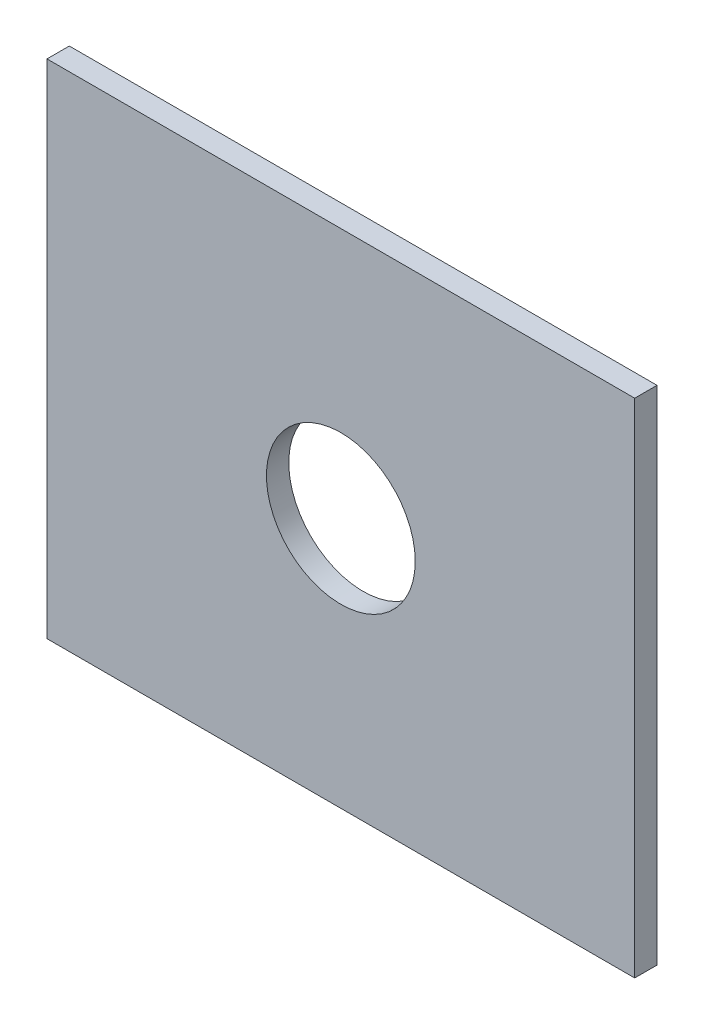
from build123d import *

# Parameters (mm, degrees)
ESQUISSE1_W        = 158
ESQUISSE1_H        = 135
ESQUISSE1_R        = 20
BOSS_EXTRU_1_DEPTH = 6


with BuildPart() as part:
    # Esquisse1 → Boss.-Extru.1 (new body)
    with BuildSketch(Plane.XY):
        with Locations((3.845226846, -4.939432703)):
            Rectangle(ESQUISSE1_W, ESQUISSE1_H)
        with Locations((3.845226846, -4.939432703)):
            Circle(ESQUISSE1_R, mode=Mode.SUBTRACT)
    extrude(amount=BOSS_EXTRU_1_DEPTH)


solid = part.part
